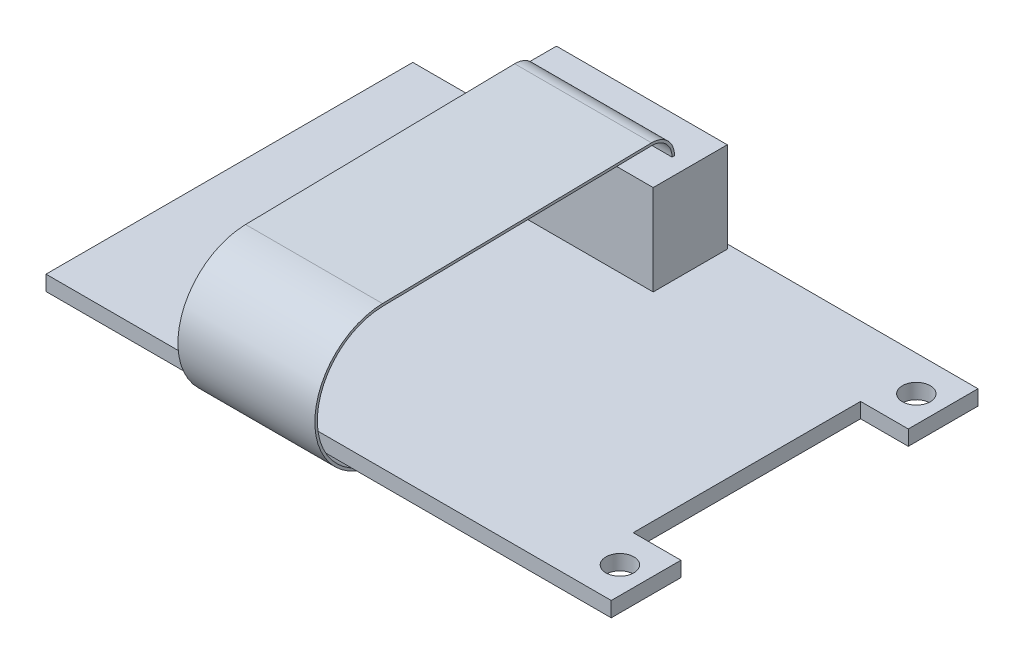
from build123d import *

# Parameters (mm, degrees)
SKETCH1_R         = 1.4097
EXTRUDE1_DEPTH    = 1.524
SKETCH2_W         = 17.272
SKETCH2_H         = 7.493
HEADER_CONN_DEPTH = 9.144
SKETCH3_W         = 13.843
SKETCH3_H         = 0.254


with BuildPart() as part:
    # Sketch1 → Extrude1 (new body)
    with BuildSketch(Plane(origin=(0, 0, 0), x_dir=(1, 0, 0), z_dir=(0, 1, 0))):
        Polygon((0, -11.4935), (0, -18.542), (-57.15, -18.542), (-57.15, 18.542), (0, 18.542), (0, 11.4935), (-4.826, 11.4935), (-4.826, -11.4935), align=None)
        with Locations(Location((-2.6797, -14.986, 0), (0, 0, 90))):
            Circle(SKETCH1_R, mode=Mode.SUBTRACT)
        with Locations(Location((-2.6797, 14.986, 0), (0, 0, 90))):
            Circle(SKETCH1_R, mode=Mode.SUBTRACT)
    extrude(amount=EXTRUDE1_DEPTH)

    # Sketch2 → Header_Conn (add)
    with BuildSketch(Plane(origin=(0, 1.524, 0), x_dir=(1, 0, 0), z_dir=(0, 1, 0))):
        with Locations((-33.528, 14.3383)):
            Rectangle(SKETCH2_W, SKETCH2_H)
    extrude(amount=HEADER_CONN_DEPTH)

    # Sweep4: sweep along a path in Sketch4
    with BuildLine(Plane(origin=(-26.6065, 0, 0), x_dir=(0, 0, -1), z_dir=(1, 0, 0))) as sweep4_path:
        ThreePointArc((14.2113, 10.668), (13.603547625, 12.117324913), (12.14383671, 12.699690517))
        Line((12.14383671, 12.699690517), (-15.057440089, 12.224890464))
        ThreePointArc((-15.057440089, 12.224890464), (-21.593945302, 6.390836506), (-16.790130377, -0.936198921))
        ThreePointArc((-16.790130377, -0.936198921), (-15.972369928, -1.480453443), (-15.6193213, -2.397133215))
    # Sketch3 → Sweep4 (sweep)
    with BuildSketch(Plane(origin=(0, 10.668, 0), x_dir=(1, 0, 0), z_dir=(0, 1, 0))):
        with Locations((-33.528, 14.3383)):
            Rectangle(SKETCH3_W, SKETCH3_H)
    sweep(path=sweep4_path.line)


solid = part.part
